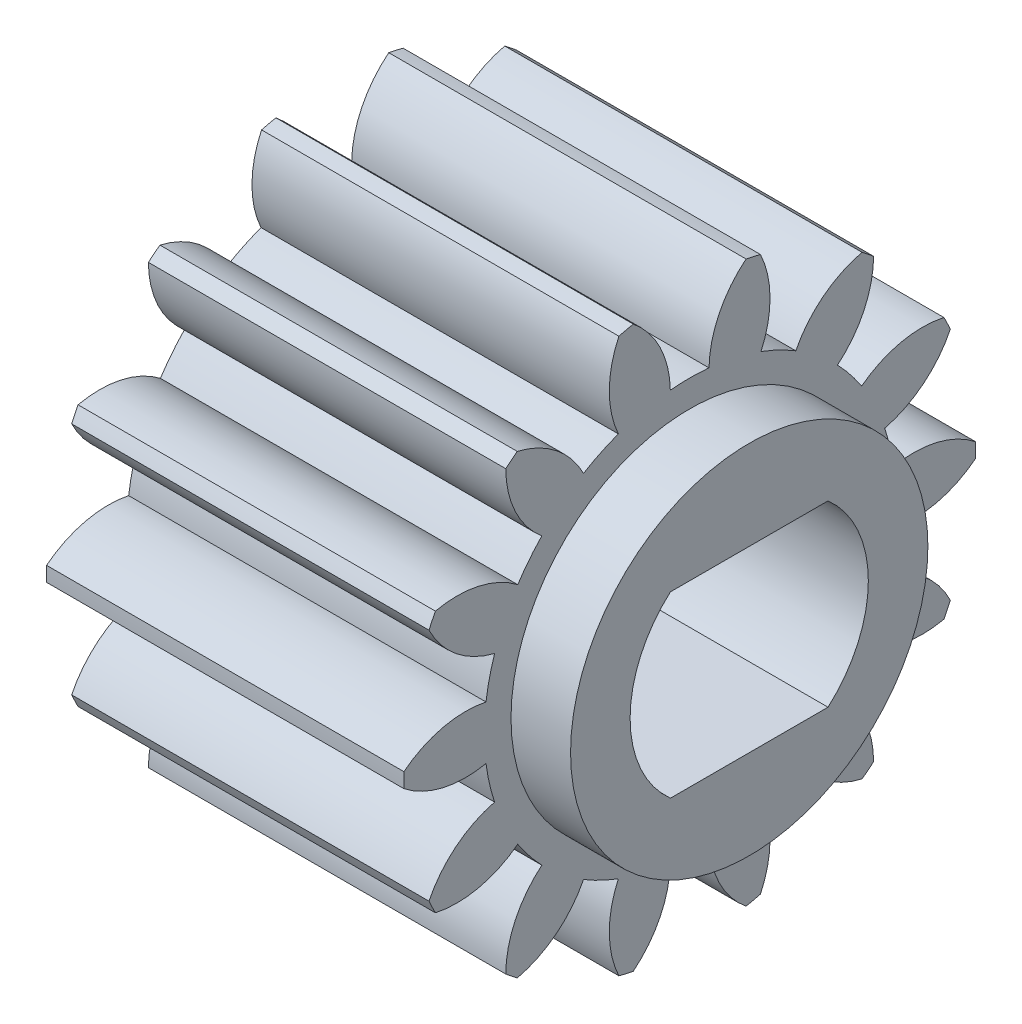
from build123d import *

# Parameters (mm, degrees)
BASPROSKE_W      = 6
BASPROSKE_H      = 4.8
TOOTHCUT_DEPTH   = 10.059801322
TEETHCUTS_COUNT  = 14
ESQUISSE1_R      = 3
EXTRUSION1_DEPTH = 1
BORE_DEPTH       = 50.0000508


with BuildPart() as part:
    # BasProSke → Base-Revolve (revolve)
    with BuildSketch(Plane(origin=(0, 0, 0), x_dir=(1, 0, 0), z_dir=(0, 1, 0)), mode=Mode.PRIVATE) as base_revolve_sk:
        with Locations((3, 2.4)):
            Rectangle(BASPROSKE_W, BASPROSKE_H)
    revolve(base_revolve_sk.sketch.rotate(Axis((-10, 0, 0), (1, 0, 0)), 180), axis=Axis((-10, 0, 0), (1, 0, 0)))

    # TooCutSke → ToothCut (cut, through all)
    with BuildSketch(Plane(origin=(0, 0, 0), x_dir=(0, 0, -1), z_dir=(1, 0, 0))):
        with BuildLine():
            ThreePointArc((0.324515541, 3.433699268), (0, 3.449), (-0.324515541, 3.433699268))
            ThreePointArc((-0.324515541, 3.433699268), (-0.502566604, 4.153338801), (-0.973014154, 4.726280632))
            ThreePointArc((-0.973014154, 4.726280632), (0, 4.8254), (0.973014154, 4.726280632))
            ThreePointArc((0.973014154, 4.726280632), (0.502566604, 4.153338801), (0.324515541, 3.433699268))
        make_face()
    toothcut = extrude(amount=TOOTHCUT_DEPTH, mode=Mode.SUBTRACT)

    # TeethCuts: ToothCut ×14 about axis
    teethcuts_axis = Axis((0, 0, 0), (1, 0, 0))
    for i in range(1, TEETHCUTS_COUNT):
        add(toothcut.rotate(teethcuts_axis, i * 360 / TEETHCUTS_COUNT), mode=Mode.SUBTRACT)

    # Esquisse1 → Extrusion1 (add)
    with BuildSketch(Plane(origin=(6, 0, 0), x_dir=(0, 0, -1), z_dir=(1, 0, 0))):
        with Locations(Location((0, 0, 0), (0, 0, 180))):
            Circle(ESQUISSE1_R)
    extrude(amount=EXTRUSION1_DEPTH)

    # BorSke → Bore (cut, symmetric)
    with BuildSketch(Plane(origin=(0, 0, 0), x_dir=(0, 0, -1), z_dir=(1, 0, 0))):
        with BuildLine():
            Line((-1.322875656, 1.5), (1.322875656, 1.5))
            ThreePointArc((1.322875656, 1.5), (2, 0), (1.322875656, -1.5))
            Line((1.322875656, -1.5), (-1.322875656, -1.5))
            ThreePointArc((-1.322875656, -1.5), (-2, 0), (-1.322875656, 1.5))
        make_face()
    extrude(amount=BORE_DEPTH, both=True, mode=Mode.SUBTRACT)


solid = part.part
